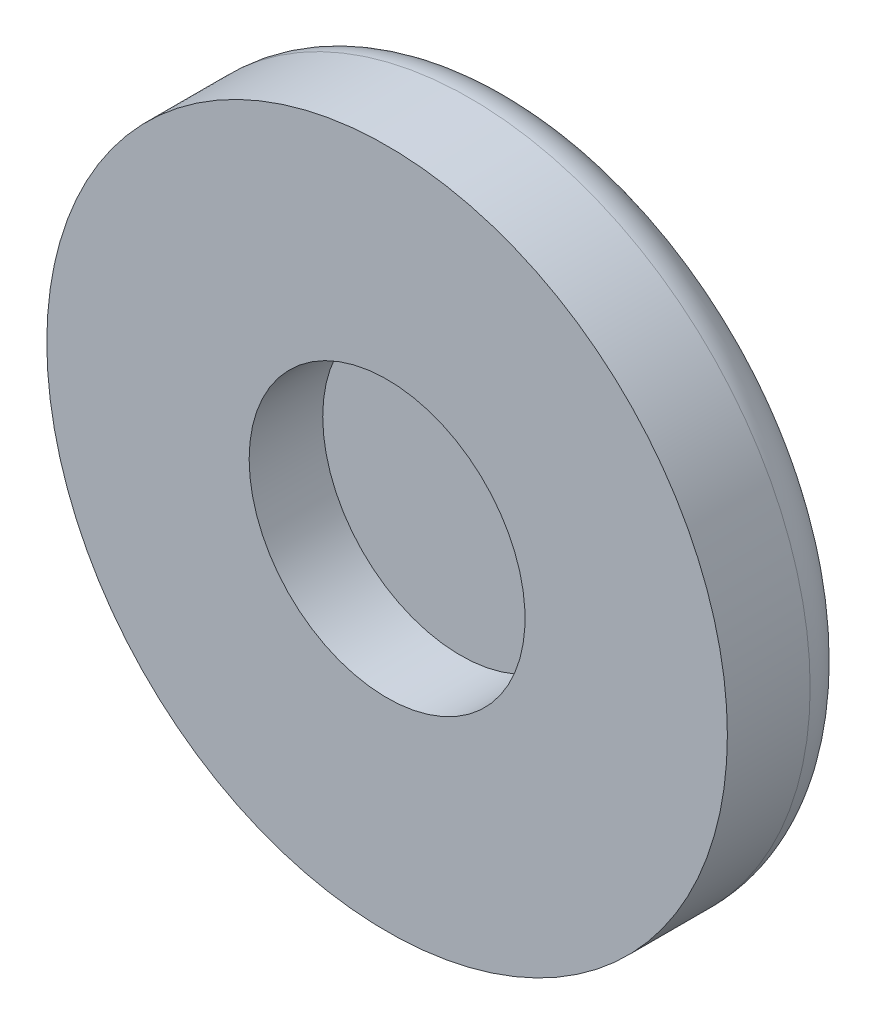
ISO-10303-21;
HEADER;
FILE_DESCRIPTION(('STEP AP214'),'2;1');
FILE_NAME('part.step','',(''),(''),'','','');
FILE_SCHEMA(('AUTOMOTIVE_DESIGN { 1 0 10303 214 1 1 1 1 }'));
ENDSEC;
DATA;
#1=APPLICATION_CONTEXT('core data for automotive mechanical design processes');
#2=APPLICATION_PROTOCOL_DEFINITION('international standard','automotive_design',2000,#1);
#3=PRODUCT_CONTEXT('',#1,'mechanical');
#4=PRODUCT('Part','Part','',(#3));
#5=PRODUCT_RELATED_PRODUCT_CATEGORY('part','',(#4));
#6=PRODUCT_DEFINITION_FORMATION('','',#4);
#7=PRODUCT_DEFINITION_CONTEXT('part definition',#1,'design');
#8=PRODUCT_DEFINITION('design','',#6,#7);
#9=PRODUCT_DEFINITION_SHAPE('','',#8);
#10=(LENGTH_UNIT() NAMED_UNIT(*) SI_UNIT(.MILLI.,.METRE.));
#11=(NAMED_UNIT(*) PLANE_ANGLE_UNIT() SI_UNIT($,.RADIAN.));
#12=(NAMED_UNIT(*) SI_UNIT($,.STERADIAN.) SOLID_ANGLE_UNIT());
#13=UNCERTAINTY_MEASURE_WITH_UNIT(LENGTH_MEASURE(1.E-05),#10,'distance_accuracy_value','');
#14=(GEOMETRIC_REPRESENTATION_CONTEXT(3) GLOBAL_UNCERTAINTY_ASSIGNED_CONTEXT((#13)) GLOBAL_UNIT_ASSIGNED_CONTEXT((#10,
#11,#12)) REPRESENTATION_CONTEXT('',''));
#15=CARTESIAN_POINT('',(0.,0.,0.));
#16=DIRECTION('',(0.,0.,1.));
#17=DIRECTION('',(1.,0.,0.));
#18=AXIS2_PLACEMENT_3D('',#15,#16,#17);
#19=CARTESIAN_POINT('',(0.,0.,0.));
#20=DIRECTION('',(0.,0.,-1.));
#21=DIRECTION('',(-1.,0.,0.));
#22=AXIS2_PLACEMENT_3D('',#19,#20,#21);
#23=PLANE('',#22);
#24=CARTESIAN_POINT('',(0.,0.,0.));
#25=DIRECTION('',(0.,0.,1.));
#26=DIRECTION('',(1.,0.,0.));
#27=AXIS2_PLACEMENT_3D('',#24,#25,#26);
#28=CIRCLE('',#27,16.);
#29=CARTESIAN_POINT('',(16.,0.,0.));
#30=VERTEX_POINT('',#29);
#31=EDGE_CURVE('E52',#30,#30,#28,.T.);
#32=ORIENTED_EDGE('',*,*,#31,.F.);
#33=EDGE_LOOP('',(#32));
#34=FACE_BOUND('',#33,.T.);
#35=ADVANCED_FACE('F13',(#34),#23,.T.);
#36=CARTESIAN_POINT('',(0.,0.,2.5));
#37=DIRECTION('',(0.,0.,-1.));
#38=DIRECTION('',(-1.,0.,0.));
#39=AXIS2_PLACEMENT_3D('',#36,#37,#38);
#40=TOROIDAL_SURFACE('',#39,16.,2.5);
#41=ORIENTED_EDGE('',*,*,#31,.T.);
#42=EDGE_LOOP('',(#41));
#43=FACE_BOUND('',#42,.T.);
#44=CARTESIAN_POINT('',(0.,0.,2.5));
#45=DIRECTION('',(0.,0.,1.));
#46=DIRECTION('',(1.,0.,0.));
#47=AXIS2_PLACEMENT_3D('',#44,#45,#46);
#48=CIRCLE('',#47,18.5);
#49=CARTESIAN_POINT('',(18.5,0.,2.5));
#50=VERTEX_POINT('',#49);
#51=EDGE_CURVE('E60',#50,#50,#48,.T.);
#52=ORIENTED_EDGE('',*,*,#51,.F.);
#53=EDGE_LOOP('',(#52));
#54=FACE_BOUND('',#53,.T.);
#55=ADVANCED_FACE('F32',(#43,#54),#40,.T.);
#56=CARTESIAN_POINT('',(0.,0.,3.));
#57=DIRECTION('',(0.,0.,-1.));
#58=DIRECTION('',(-1.,0.,0.));
#59=AXIS2_PLACEMENT_3D('',#56,#57,#58);
#60=PLANE('',#59);
#61=CARTESIAN_POINT('',(0.,0.,3.));
#62=DIRECTION('',(0.,0.,-1.));
#63=DIRECTION('',(-1.,0.,0.));
#64=AXIS2_PLACEMENT_3D('',#61,#62,#63);
#65=CIRCLE('',#64,7.5);
#66=CARTESIAN_POINT('',(-7.5,0.,3.));
#67=VERTEX_POINT('',#66);
#68=EDGE_CURVE('E17',#67,#67,#65,.F.);
#69=ORIENTED_EDGE('',*,*,#68,.T.);
#70=EDGE_LOOP('',(#69));
#71=FACE_BOUND('',#70,.T.);
#72=ADVANCED_FACE('F42',(#71),#60,.F.);
#73=CARTESIAN_POINT('',(0.,0.,0.));
#74=DIRECTION('',(0.,0.,1.));
#75=DIRECTION('',(1.,0.,0.));
#76=AXIS2_PLACEMENT_3D('',#73,#74,#75);
#77=CYLINDRICAL_SURFACE('',#76,18.5);
#78=ORIENTED_EDGE('',*,*,#51,.T.);
#79=EDGE_LOOP('',(#78));
#80=FACE_BOUND('',#79,.T.);
#81=CARTESIAN_POINT('',(0.,0.,7.));
#82=DIRECTION('',(0.,0.,1.));
#83=DIRECTION('',(1.,0.,0.));
#84=AXIS2_PLACEMENT_3D('',#81,#82,#83);
#85=CIRCLE('',#84,18.5);
#86=CARTESIAN_POINT('',(18.5,0.,7.));
#87=VERTEX_POINT('',#86);
#88=EDGE_CURVE('E21',#87,#87,#85,.F.);
#89=ORIENTED_EDGE('',*,*,#88,.T.);
#90=EDGE_LOOP('',(#89));
#91=FACE_BOUND('',#90,.T.);
#92=ADVANCED_FACE('F71',(#80,#91),#77,.T.);
#93=CARTESIAN_POINT('',(0.,0.,7.));
#94=DIRECTION('',(0.,0.,-1.));
#95=DIRECTION('',(-1.,0.,0.));
#96=AXIS2_PLACEMENT_3D('',#93,#94,#95);
#97=CYLINDRICAL_SURFACE('',#96,7.5);
#98=CARTESIAN_POINT('',(0.,0.,7.));
#99=DIRECTION('',(0.,0.,-1.));
#100=DIRECTION('',(-1.,0.,0.));
#101=AXIS2_PLACEMENT_3D('',#98,#99,#100);
#102=CIRCLE('',#101,7.5);
#103=CARTESIAN_POINT('',(-7.5,0.,7.));
#104=VERTEX_POINT('',#103);
#105=EDGE_CURVE('E9',#104,#104,#102,.F.);
#106=ORIENTED_EDGE('',*,*,#105,.T.);
#107=EDGE_LOOP('',(#106));
#108=FACE_BOUND('',#107,.T.);
#109=ORIENTED_EDGE('',*,*,#68,.F.);
#110=EDGE_LOOP('',(#109));
#111=FACE_BOUND('',#110,.T.);
#112=ADVANCED_FACE('F68',(#108,#111),#97,.F.);
#113=CARTESIAN_POINT('',(0.,0.,7.));
#114=DIRECTION('',(0.,0.,-1.));
#115=DIRECTION('',(-1.,0.,0.));
#116=AXIS2_PLACEMENT_3D('',#113,#114,#115);
#117=PLANE('',#116);
#118=ORIENTED_EDGE('',*,*,#105,.F.);
#119=EDGE_LOOP('',(#118));
#120=FACE_BOUND('',#119,.T.);
#121=ORIENTED_EDGE('',*,*,#88,.F.);
#122=EDGE_LOOP('',(#121));
#123=FACE_BOUND('',#122,.T.);
#124=ADVANCED_FACE('F70',(#120,#123),#117,.F.);
#125=CLOSED_SHELL('',(#35,#55,#72,#92,#112,#124));
#126=MANIFOLD_SOLID_BREP('B1',#125);
#127=ADVANCED_BREP_SHAPE_REPRESENTATION('',(#18,#126),#14);
#128=SHAPE_DEFINITION_REPRESENTATION(#9,#127);
ENDSEC;
END-ISO-10303-21;
